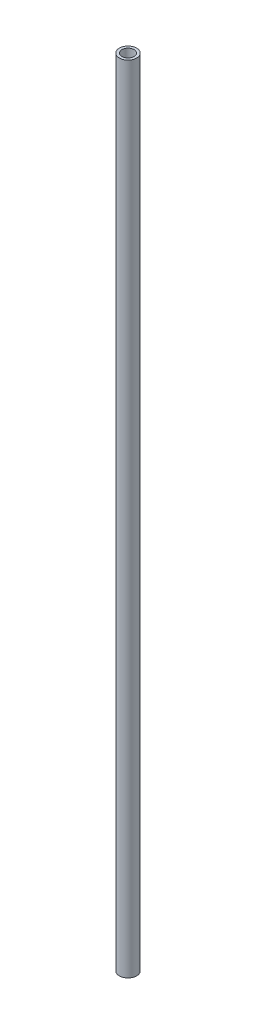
from build123d import *

# Parameters (mm, degrees)
SKETCH1_R           = 1.25
SKETCH1_R_2         = 0.875
BOSS_EXTRUDE1_DEPTH = 115


with BuildPart() as part:
    # Sketch1 → Boss-Extrude1 (new body)
    with BuildSketch(Plane(origin=(0, 0, 0), x_dir=(1, 0, 0), z_dir=(0, 1, 0))):
        with Locations(Location((0, 0, 0), (0, 0, 270))):
            Circle(SKETCH1_R)
        with Locations(Location((0, 0, 0), (0, 0, 270))):
            Circle(SKETCH1_R_2, mode=Mode.SUBTRACT)
    extrude(amount=BOSS_EXTRUDE1_DEPTH)


solid = part.part
